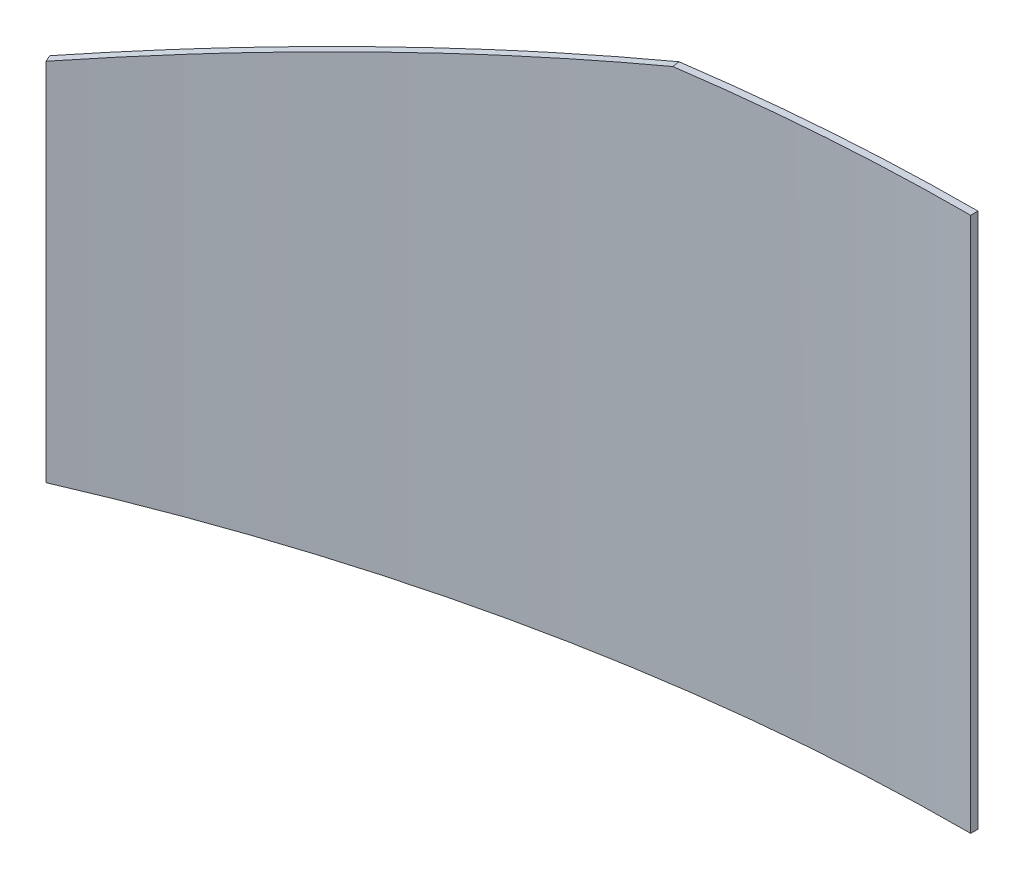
ISO-10303-21;
HEADER;
FILE_DESCRIPTION(('STEP AP214'),'2;1');
FILE_NAME('part.step','',(''),(''),'','','');
FILE_SCHEMA(('AUTOMOTIVE_DESIGN { 1 0 10303 214 1 1 1 1 }'));
ENDSEC;
DATA;
#1=APPLICATION_CONTEXT('core data for automotive mechanical design processes');
#2=APPLICATION_PROTOCOL_DEFINITION('international standard','automotive_design',2000,#1);
#3=PRODUCT_CONTEXT('',#1,'mechanical');
#4=PRODUCT('Part','Part','',(#3));
#5=PRODUCT_RELATED_PRODUCT_CATEGORY('part','',(#4));
#6=PRODUCT_DEFINITION_FORMATION('','',#4);
#7=PRODUCT_DEFINITION_CONTEXT('part definition',#1,'design');
#8=PRODUCT_DEFINITION('design','',#6,#7);
#9=PRODUCT_DEFINITION_SHAPE('','',#8);
#10=(LENGTH_UNIT() NAMED_UNIT(*) SI_UNIT(.MILLI.,.METRE.));
#11=(NAMED_UNIT(*) PLANE_ANGLE_UNIT() SI_UNIT($,.RADIAN.));
#12=(NAMED_UNIT(*) SI_UNIT($,.STERADIAN.) SOLID_ANGLE_UNIT());
#13=UNCERTAINTY_MEASURE_WITH_UNIT(LENGTH_MEASURE(1.E-05),#10,'distance_accuracy_value','');
#14=(GEOMETRIC_REPRESENTATION_CONTEXT(3) GLOBAL_UNCERTAINTY_ASSIGNED_CONTEXT((#13)) GLOBAL_UNIT_ASSIGNED_CONTEXT((#10,
#11,#12)) REPRESENTATION_CONTEXT('',''));
#15=CARTESIAN_POINT('',(0.,0.,0.));
#16=DIRECTION('',(0.,0.,1.));
#17=DIRECTION('',(1.,0.,0.));
#18=AXIS2_PLACEMENT_3D('',#15,#16,#17);
#19=CARTESIAN_POINT('',(-1.11022302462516E-13,220.,-1.11022302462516E-13));
#20=DIRECTION('',(0.,-1.,0.));
#21=DIRECTION('',(0.,0.,-1.));
#22=AXIS2_PLACEMENT_3D('',#19,#20,#21);
#23=PLANE('',#22);
#24=DIRECTION('',(0.,0.,1.));
#25=VECTOR('',#24,1.);
#26=CARTESIAN_POINT('',(-7.21644966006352E-13,220.,-793.000000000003));
#27=LINE('',#26,#25);
#28=CARTESIAN_POINT('',(-7.7715611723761E-13,220.,-796.000000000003));
#29=VERTEX_POINT('',#28);
#30=CARTESIAN_POINT('',(-7.21644966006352E-13,220.,-793.000000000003));
#31=VERTEX_POINT('',#30);
#32=EDGE_CURVE('E12',#29,#31,#27,.T.);
#33=ORIENTED_EDGE('',*,*,#32,.F.);
#34=CARTESIAN_POINT('',(-1.11022302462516E-13,220.,-1.11022302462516E-13));
#35=DIRECTION('',(0.,-1.,0.));
#36=DIRECTION('',(0.,0.,-1.));
#37=AXIS2_PLACEMENT_3D('',#34,#35,#36);
#38=CIRCLE('',#37,796.);
#39=CARTESIAN_POINT('',(-114.600365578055,220.,-787.707278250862));
#40=VERTEX_POINT('',#39);
#41=EDGE_CURVE('E105',#29,#40,#38,.F.);
#42=ORIENTED_EDGE('',*,*,#41,.T.);
#43=CARTESIAN_POINT('',(-114.168454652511,220.,-784.738532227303));
#44=CARTESIAN_POINT('',(-114.600365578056,220.,-787.707278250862));
#45=B_SPLINE_CURVE_WITH_KNOTS('',1,(#43,#44),.UNSPECIFIED.,.F.,.F.,(2,2),(0.,1.),.UNSPECIFIED.);
#46=CARTESIAN_POINT('',(-114.16845465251,220.,-784.738532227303));
#47=VERTEX_POINT('',#46);
#48=EDGE_CURVE('E48',#40,#47,#45,.F.);
#49=ORIENTED_EDGE('',*,*,#48,.T.);
#50=CARTESIAN_POINT('',(-1.11022302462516E-13,220.,-1.11022302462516E-13));
#51=DIRECTION('',(0.,1.,0.));
#52=DIRECTION('',(0.,0.,1.));
#53=AXIS2_PLACEMENT_3D('',#50,#51,#52);
#54=CIRCLE('',#53,793.);
#55=EDGE_CURVE('E171',#31,#47,#54,.T.);
#56=ORIENTED_EDGE('',*,*,#55,.F.);
#57=EDGE_LOOP('',(#33,#42,#49,#56));
#58=FACE_BOUND('',#57,.T.);
#59=ADVANCED_FACE('F39',(#58),#23,.F.);
#60=CARTESIAN_POINT('',(-114.600365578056,220.,-787.707278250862));
#61=CARTESIAN_POINT('',(-149.235807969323,208.333309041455,-782.668306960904));
#62=CARTESIAN_POINT('',(-183.538106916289,196.666666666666,-775.34170744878));
#63=CARTESIAN_POINT('',(-250.881538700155,173.333333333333,-756.240341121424));
#64=CARTESIAN_POINT('',(-283.922192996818,161.666690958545,-744.46571003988));
#65=CARTESIAN_POINT('',(-316.04527825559,150.,-730.569217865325));
#66=CARTESIAN_POINT('',(-114.168454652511,220.,-784.738532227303));
#67=CARTESIAN_POINT('',(-148.673361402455,208.333309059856,-779.718552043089));
#68=CARTESIAN_POINT('',(-182.846380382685,196.666666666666,-772.419565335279));
#69=CARTESIAN_POINT('',(-249.936005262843,173.333333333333,-753.390189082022));
#70=CARTESIAN_POINT('',(-282.852134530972,161.666690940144,-741.65993472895));
#71=CARTESIAN_POINT('',(-314.854152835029,150.,-727.815816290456));
#72=B_SPLINE_SURFACE_WITH_KNOTS('',1,3,((#60,#61,#62,#63,#64,#65),(#66,#67,#68,#69,#70,#71)),
.UNSPECIFIED.,.F.,.F.,.F.,(2,2),(4,2,4),(0.,1.),(0.,0.5,1.),.UNSPECIFIED.);
#73=CARTESIAN_POINT('',(-114.600365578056,220.,-787.707278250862));
#74=CARTESIAN_POINT('',(-149.235807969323,208.333309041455,-782.668306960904));
#75=CARTESIAN_POINT('',(-183.538106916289,196.666666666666,-775.34170744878));
#76=CARTESIAN_POINT('',(-250.881538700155,173.333333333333,-756.240341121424));
#77=CARTESIAN_POINT('',(-283.922192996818,161.666690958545,-744.46571003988));
#78=CARTESIAN_POINT('',(-316.04527825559,150.,-730.569217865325));
#79=B_SPLINE_CURVE_WITH_KNOTS('',3,(#73,#74,#75,#76,#77,#78),.UNSPECIFIED.,.F.,.F.,(4,2,4),(0.,
0.5,1.),.UNSPECIFIED.);
#80=CARTESIAN_POINT('',(-316.04527825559,150.,-730.569217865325));
#81=VERTEX_POINT('',#80);
#82=EDGE_CURVE('E103',#40,#81,#79,.T.);
#83=CARTESIAN_POINT('',(-316.04527825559,150.,-730.569217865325));
#84=CARTESIAN_POINT('',(-314.854152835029,150.,-727.815816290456));
#85=B_SPLINE_CURVE_WITH_KNOTS('',1,(#83,#84),.UNSPECIFIED.,.F.,.F.,(2,2),(0.,1.),.UNSPECIFIED.);
#86=CARTESIAN_POINT('',(-314.854152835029,150.,-727.815816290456));
#87=VERTEX_POINT('',#86);
#88=EDGE_CURVE('E89',#81,#87,#85,.T.);
#89=CARTESIAN_POINT('',(-314.854152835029,150.,-727.815816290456));
#90=CARTESIAN_POINT('',(-282.852134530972,161.666690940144,-741.65993472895));
#91=CARTESIAN_POINT('',(-249.936005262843,173.333333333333,-753.390189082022));
#92=CARTESIAN_POINT('',(-182.846380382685,196.666666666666,-772.419565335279));
#93=CARTESIAN_POINT('',(-148.673361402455,208.333309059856,-779.718552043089));
#94=CARTESIAN_POINT('',(-114.168454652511,220.,-784.738532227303));
#95=B_SPLINE_CURVE_WITH_KNOTS('',3,(#89,#90,#91,#92,#93,#94),.UNSPECIFIED.,.F.,.F.,(4,2,4),(0.,
0.5,1.),.UNSPECIFIED.);
#96=EDGE_CURVE('E178',#47,#87,#95,.F.);
#97=ORIENTED_EDGE('',*,*,#48,.F.);
#98=ORIENTED_EDGE('',*,*,#82,.T.);
#99=ORIENTED_EDGE('',*,*,#88,.T.);
#100=ORIENTED_EDGE('',*,*,#96,.F.);
#101=EDGE_LOOP('',(#97,#98,#99,#100));
#102=FACE_BOUND('',#101,.T.);
#103=ADVANCED_FACE('F136',(#102),#72,.F.);
#104=CARTESIAN_POINT('',(-314.854152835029,75.,-727.815816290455));
#105=DIRECTION('',(0.917800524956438,0.,-0.397041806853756));
#106=DIRECTION('',(0.,-1.,0.));
#107=AXIS2_PLACEMENT_3D('',#104,#105,#106);
#108=PLANE('',#107);
#109=ORIENTED_EDGE('',*,*,#88,.F.);
#110=DIRECTION('',(0.,-1.,0.));
#111=VECTOR('',#110,1.);
#112=CARTESIAN_POINT('',(-316.04527825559,502.471655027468,-730.569217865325));
#113=LINE('',#112,#111);
#114=CARTESIAN_POINT('',(-316.04527825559,0.,-730.569217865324));
#115=VERTEX_POINT('',#114);
#116=EDGE_CURVE('E95',#81,#115,#113,.T.);
#117=ORIENTED_EDGE('',*,*,#116,.T.);
#118=DIRECTION('',(0.397041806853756,0.,0.917800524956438));
#119=VECTOR('',#118,1.);
#120=CARTESIAN_POINT('',(-314.854152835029,0.,-727.815816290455));
#121=LINE('',#120,#119);
#122=CARTESIAN_POINT('',(-314.854152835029,0.,-727.815816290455));
#123=VERTEX_POINT('',#122);
#124=EDGE_CURVE('E62',#115,#123,#121,.T.);
#125=ORIENTED_EDGE('',*,*,#124,.T.);
#126=DIRECTION('',(0.,-1.,0.));
#127=VECTOR('',#126,1.);
#128=CARTESIAN_POINT('',(-314.854152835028,150.,-727.815816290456));
#129=LINE('',#128,#127);
#130=EDGE_CURVE('E116',#87,#123,#129,.T.);
#131=ORIENTED_EDGE('',*,*,#130,.F.);
#132=EDGE_LOOP('',(#109,#117,#125,#131));
#133=FACE_BOUND('',#132,.T.);
#134=ADVANCED_FACE('F101',(#133),#108,.F.);
#135=CARTESIAN_POINT('',(0.,0.,0.));
#136=DIRECTION('',(0.,1.,0.));
#137=DIRECTION('',(0.,0.,1.));
#138=AXIS2_PLACEMENT_3D('',#135,#136,#137);
#139=PLANE('',#138);
#140=ORIENTED_EDGE('',*,*,#124,.F.);
#141=CARTESIAN_POINT('',(0.,0.,0.));
#142=DIRECTION('',(0.,-1.,0.));
#143=DIRECTION('',(0.,0.,-1.));
#144=AXIS2_PLACEMENT_3D('',#141,#142,#143);
#145=CIRCLE('',#144,796.);
#146=CARTESIAN_POINT('',(-3.88578058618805E-13,0.,-796.000000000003));
#147=VERTEX_POINT('',#146);
#148=EDGE_CURVE('E86',#115,#147,#145,.T.);
#149=ORIENTED_EDGE('',*,*,#148,.T.);
#150=DIRECTION('',(0.,0.,1.));
#151=VECTOR('',#150,1.);
#152=CARTESIAN_POINT('',(-4.44089209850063E-13,0.,-793.000000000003));
#153=LINE('',#152,#151);
#154=CARTESIAN_POINT('',(-4.44089209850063E-13,0.,-793.000000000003));
#155=VERTEX_POINT('',#154);
#156=EDGE_CURVE('E43',#147,#155,#153,.T.);
#157=ORIENTED_EDGE('',*,*,#156,.T.);
#158=CARTESIAN_POINT('',(0.,0.,0.));
#159=DIRECTION('',(0.,-1.,0.));
#160=DIRECTION('',(0.,0.,-1.));
#161=AXIS2_PLACEMENT_3D('',#158,#159,#160);
#162=CIRCLE('',#161,793.);
#163=EDGE_CURVE('E88',#123,#155,#162,.T.);
#164=ORIENTED_EDGE('',*,*,#163,.F.);
#165=EDGE_LOOP('',(#140,#149,#157,#164));
#166=FACE_BOUND('',#165,.T.);
#167=ADVANCED_FACE('F85',(#166),#139,.F.);
#168=CARTESIAN_POINT('',(-3.33066907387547E-13,110.,-793.000000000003));
#169=DIRECTION('',(-1.,0.,0.));
#170=DIRECTION('',(0.,1.,0.));
#171=AXIS2_PLACEMENT_3D('',#168,#169,#170);
#172=PLANE('',#171);
#173=DIRECTION('',(0.,-1.,0.));
#174=VECTOR('',#173,1.);
#175=CARTESIAN_POINT('',(1.11022302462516E-13,502.471655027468,-796.000000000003));
#176=LINE('',#175,#174);
#177=EDGE_CURVE('E99',#147,#29,#176,.F.);
#178=ORIENTED_EDGE('',*,*,#177,.T.);
#179=ORIENTED_EDGE('',*,*,#32,.T.);
#180=DIRECTION('',(0.,1.,0.));
#181=VECTOR('',#180,1.);
#182=CARTESIAN_POINT('',(-4.44089209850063E-13,0.,-793.000000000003));
#183=LINE('',#182,#181);
#184=EDGE_CURVE('E108',#155,#31,#183,.T.);
#185=ORIENTED_EDGE('',*,*,#184,.F.);
#186=ORIENTED_EDGE('',*,*,#156,.F.);
#187=EDGE_LOOP('',(#178,#179,#185,#186));
#188=FACE_BOUND('',#187,.T.);
#189=ADVANCED_FACE('F41',(#188),#172,.F.);
#190=CARTESIAN_POINT('',(-1.66533453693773E-13,502.471655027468,-3.33066907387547E-13));
#191=DIRECTION('',(0.,-1.,0.));
#192=DIRECTION('',(0.,0.,-1.));
#193=AXIS2_PLACEMENT_3D('',#190,#191,#192);
#194=CYLINDRICAL_SURFACE('',#193,793.);
#195=ORIENTED_EDGE('',*,*,#163,.T.);
#196=ORIENTED_EDGE('',*,*,#184,.T.);
#197=ORIENTED_EDGE('',*,*,#55,.T.);
#198=ORIENTED_EDGE('',*,*,#96,.T.);
#199=ORIENTED_EDGE('',*,*,#130,.T.);
#200=EDGE_LOOP('',(#195,#196,#197,#198,#199));
#201=FACE_BOUND('',#200,.T.);
#202=ADVANCED_FACE('F119',(#201),#194,.F.);
#203=CARTESIAN_POINT('',(-1.66533453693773E-13,502.471655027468,-3.33066907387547E-13));
#204=DIRECTION('',(0.,-1.,0.));
#205=DIRECTION('',(0.,0.,-1.));
#206=AXIS2_PLACEMENT_3D('',#203,#204,#205);
#207=CYLINDRICAL_SURFACE('',#206,796.);
#208=ORIENTED_EDGE('',*,*,#148,.F.);
#209=ORIENTED_EDGE('',*,*,#116,.F.);
#210=ORIENTED_EDGE('',*,*,#82,.F.);
#211=ORIENTED_EDGE('',*,*,#41,.F.);
#212=ORIENTED_EDGE('',*,*,#177,.F.);
#213=EDGE_LOOP('',(#208,#209,#210,#211,#212));
#214=FACE_BOUND('',#213,.T.);
#215=ADVANCED_FACE('F93',(#214),#207,.T.);
#216=CLOSED_SHELL('',(#59,#103,#134,#167,#189,#202,#215));
#217=MANIFOLD_SOLID_BREP('B2',#216);
#218=ADVANCED_BREP_SHAPE_REPRESENTATION('',(#18,#217),#14);
#219=SHAPE_DEFINITION_REPRESENTATION(#9,#218);
ENDSEC;
END-ISO-10303-21;
